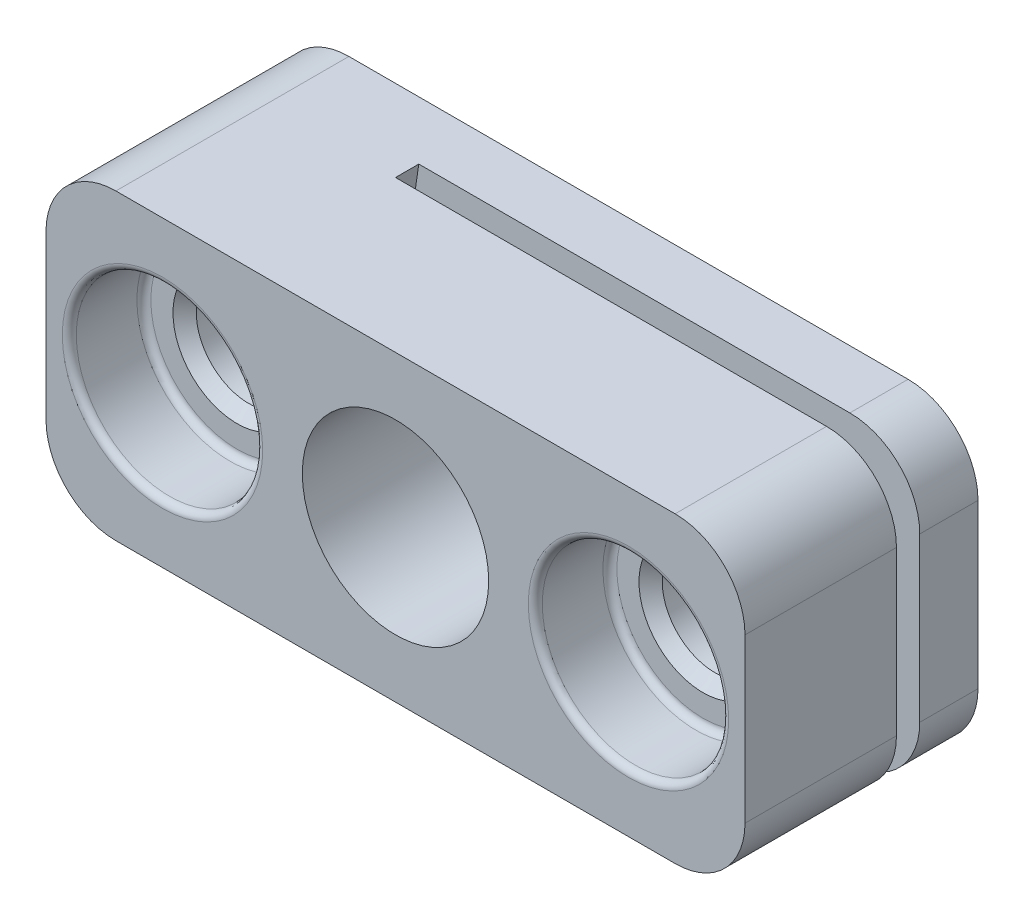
ISO-10303-21;
HEADER;
FILE_DESCRIPTION(('STEP AP214'),'2;1');
FILE_NAME('part.step','',(''),(''),'','','');
FILE_SCHEMA(('AUTOMOTIVE_DESIGN { 1 0 10303 214 1 1 1 1 }'));
ENDSEC;
DATA;
#1=APPLICATION_CONTEXT('core data for automotive mechanical design processes');
#2=APPLICATION_PROTOCOL_DEFINITION('international standard','automotive_design',2000,#1);
#3=PRODUCT_CONTEXT('',#1,'mechanical');
#4=PRODUCT('Part','Part','',(#3));
#5=PRODUCT_RELATED_PRODUCT_CATEGORY('part','',(#4));
#6=PRODUCT_DEFINITION_FORMATION('','',#4);
#7=PRODUCT_DEFINITION_CONTEXT('part definition',#1,'design');
#8=PRODUCT_DEFINITION('design','',#6,#7);
#9=PRODUCT_DEFINITION_SHAPE('','',#8);
#10=(LENGTH_UNIT() NAMED_UNIT(*) SI_UNIT(.MILLI.,.METRE.));
#11=(NAMED_UNIT(*) PLANE_ANGLE_UNIT() SI_UNIT($,.RADIAN.));
#12=(NAMED_UNIT(*) SI_UNIT($,.STERADIAN.) SOLID_ANGLE_UNIT());
#13=UNCERTAINTY_MEASURE_WITH_UNIT(LENGTH_MEASURE(1.E-05),#10,'distance_accuracy_value','');
#14=(GEOMETRIC_REPRESENTATION_CONTEXT(3) GLOBAL_UNCERTAINTY_ASSIGNED_CONTEXT((#13)) GLOBAL_UNIT_ASSIGNED_CONTEXT((#10,
#11,#12)) REPRESENTATION_CONTEXT('',''));
#15=CARTESIAN_POINT('',(0.,0.,0.));
#16=DIRECTION('',(0.,0.,1.));
#17=DIRECTION('',(1.,0.,0.));
#18=AXIS2_PLACEMENT_3D('',#15,#16,#17);
#19=CARTESIAN_POINT('',(22.75,0.,6.8));
#20=DIRECTION('',(0.,0.,1.));
#21=DIRECTION('',(1.,0.,0.));
#22=AXIS2_PLACEMENT_3D('',#19,#20,#21);
#23=PLANE('',#22);
#24=CARTESIAN_POINT('',(20.,0.,6.79999999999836));
#25=DIRECTION('',(0.,0.,1.));
#26=DIRECTION('',(1.,0.,0.));
#27=AXIS2_PLACEMENT_3D('',#24,#25,#26);
#28=CIRCLE('',#27,2.74999999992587);
#29=CARTESIAN_POINT('',(22.7499999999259,0.,6.79999999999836));
#30=VERTEX_POINT('',#29);
#31=EDGE_CURVE('E18',#30,#30,#28,.F.);
#32=ORIENTED_EDGE('',*,*,#31,.T.);
#33=EDGE_LOOP('',(#32));
#34=FACE_BOUND('',#33,.T.);
#35=CARTESIAN_POINT('',(20.,0.,6.8));
#36=DIRECTION('',(0.,0.,-1.));
#37=DIRECTION('',(1.,0.,0.));
#38=AXIS2_PLACEMENT_3D('',#35,#36,#37);
#39=CIRCLE('',#38,3.70000000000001);
#40=CARTESIAN_POINT('',(23.7,0.,6.8));
#41=VERTEX_POINT('',#40);
#42=EDGE_CURVE('E285',#41,#41,#39,.F.);
#43=ORIENTED_EDGE('',*,*,#42,.T.);
#44=EDGE_LOOP('',(#43));
#45=FACE_BOUND('',#44,.T.);
#46=ADVANCED_FACE('F14',(#34,#45),#23,.T.);
#47=CARTESIAN_POINT('',(20.,0.,7.1));
#48=DIRECTION('',(0.,0.,1.));
#49=DIRECTION('',(1.,0.,0.));
#50=AXIS2_PLACEMENT_3D('',#47,#48,#49);
#51=TOROIDAL_SURFACE('',#50,3.7,0.300000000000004);
#52=CARTESIAN_POINT('',(20.,0.,7.09999999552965));
#53=DIRECTION('',(0.,0.,-1.));
#54=DIRECTION('',(-1.,0.,0.));
#55=AXIS2_PLACEMENT_3D('',#52,#53,#54);
#56=CIRCLE('',#55,4.);
#57=CARTESIAN_POINT('',(16.,0.,7.09999999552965));
#58=VERTEX_POINT('',#57);
#59=EDGE_CURVE('E234',#58,#58,#56,.F.);
#60=ORIENTED_EDGE('',*,*,#59,.T.);
#61=EDGE_LOOP('',(#60));
#62=FACE_BOUND('',#61,.T.);
#63=ORIENTED_EDGE('',*,*,#42,.F.);
#64=EDGE_LOOP('',(#63));
#65=FACE_BOUND('',#64,.T.);
#66=ADVANCED_FACE('F267',(#62,#65),#51,.F.);
#67=CARTESIAN_POINT('',(0.,0.,7.1));
#68=DIRECTION('',(0.,0.,-1.));
#69=DIRECTION('',(-1.,0.,0.));
#70=AXIS2_PLACEMENT_3D('',#67,#68,#69);
#71=TOROIDAL_SURFACE('',#70,3.7,0.3);
#72=CARTESIAN_POINT('',(0.,0.,6.8));
#73=DIRECTION('',(0.,0.,-1.));
#74=DIRECTION('',(-1.,0.,0.));
#75=AXIS2_PLACEMENT_3D('',#72,#73,#74);
#76=CIRCLE('',#75,3.7);
#77=CARTESIAN_POINT('',(-3.7,0.,6.8));
#78=VERTEX_POINT('',#77);
#79=EDGE_CURVE('E245',#78,#78,#76,.F.);
#80=ORIENTED_EDGE('',*,*,#79,.F.);
#81=EDGE_LOOP('',(#80));
#82=FACE_BOUND('',#81,.T.);
#83=CARTESIAN_POINT('',(0.,0.,7.1));
#84=DIRECTION('',(0.,0.,1.));
#85=DIRECTION('',(1.,0.,0.));
#86=AXIS2_PLACEMENT_3D('',#83,#84,#85);
#87=CIRCLE('',#86,4.);
#88=CARTESIAN_POINT('',(4.,0.,7.1));
#89=VERTEX_POINT('',#88);
#90=EDGE_CURVE('E231',#89,#89,#87,.T.);
#91=ORIENTED_EDGE('',*,*,#90,.T.);
#92=EDGE_LOOP('',(#91));
#93=FACE_BOUND('',#92,.T.);
#94=ADVANCED_FACE('F263',(#82,#93),#71,.F.);
#95=CARTESIAN_POINT('',(-3.7,0.,6.8));
#96=DIRECTION('',(0.,0.,1.));
#97=DIRECTION('',(1.,0.,0.));
#98=AXIS2_PLACEMENT_3D('',#95,#96,#97);
#99=PLANE('',#98);
#100=ORIENTED_EDGE('',*,*,#79,.T.);
#101=EDGE_LOOP('',(#100));
#102=FACE_BOUND('',#101,.T.);
#103=CARTESIAN_POINT('',(0.,0.,6.79999999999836));
#104=DIRECTION('',(0.,0.,1.));
#105=DIRECTION('',(1.,0.,0.));
#106=AXIS2_PLACEMENT_3D('',#103,#104,#105);
#107=CIRCLE('',#106,2.75000000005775);
#108=CARTESIAN_POINT('',(2.75000000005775,0.,6.79999999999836));
#109=VERTEX_POINT('',#108);
#110=EDGE_CURVE('E228',#109,#109,#107,.F.);
#111=ORIENTED_EDGE('',*,*,#110,.T.);
#112=EDGE_LOOP('',(#111));
#113=FACE_BOUND('',#112,.T.);
#114=ADVANCED_FACE('F252',(#102,#113),#99,.T.);
#115=CARTESIAN_POINT('',(20.,0.,6.79999999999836));
#116=DIRECTION('',(0.,0.,1.));
#117=DIRECTION('',(1.,0.,0.));
#118=AXIS2_PLACEMENT_3D('',#115,#116,#117);
#119=CONICAL_SURFACE('',#118,2.74999999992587,0.785398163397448);
#120=CARTESIAN_POINT('',(20.,0.,6.3));
#121=DIRECTION('',(0.,0.,-1.));
#122=DIRECTION('',(-1.,0.,0.));
#123=AXIS2_PLACEMENT_3D('',#120,#121,#122);
#124=CIRCLE('',#123,2.25);
#125=CARTESIAN_POINT('',(17.75,0.,6.3));
#126=VERTEX_POINT('',#125);
#127=EDGE_CURVE('E224',#126,#126,#124,.T.);
#128=ORIENTED_EDGE('',*,*,#127,.T.);
#129=EDGE_LOOP('',(#128));
#130=FACE_BOUND('',#129,.T.);
#131=ORIENTED_EDGE('',*,*,#31,.F.);
#132=EDGE_LOOP('',(#131));
#133=FACE_BOUND('',#132,.T.);
#134=ADVANCED_FACE('F262',(#130,#133),#119,.F.);
#135=CARTESIAN_POINT('',(20.,0.,10.));
#136=DIRECTION('',(0.,0.,-1.));
#137=DIRECTION('',(-1.,0.,0.));
#138=AXIS2_PLACEMENT_3D('',#135,#136,#137);
#139=CYLINDRICAL_SURFACE('',#138,4.);
#140=ORIENTED_EDGE('',*,*,#59,.F.);
#141=EDGE_LOOP('',(#140));
#142=FACE_BOUND('',#141,.T.);
#143=CARTESIAN_POINT('',(20.,0.,9.7));
#144=DIRECTION('',(0.,0.,1.));
#145=DIRECTION('',(1.,0.,0.));
#146=AXIS2_PLACEMENT_3D('',#143,#144,#145);
#147=CIRCLE('',#146,4.);
#148=CARTESIAN_POINT('',(24.,0.,9.7));
#149=VERTEX_POINT('',#148);
#150=EDGE_CURVE('E125',#149,#149,#147,.F.);
#151=ORIENTED_EDGE('',*,*,#150,.F.);
#152=EDGE_LOOP('',(#151));
#153=FACE_BOUND('',#152,.T.);
#154=ADVANCED_FACE('F505',(#142,#153),#139,.F.);
#155=CARTESIAN_POINT('',(0.,0.,0.));
#156=DIRECTION('',(0.,0.,1.));
#157=DIRECTION('',(1.,0.,0.));
#158=AXIS2_PLACEMENT_3D('',#155,#156,#157);
#159=CYLINDRICAL_SURFACE('',#158,4.);
#160=CARTESIAN_POINT('',(0.,0.,9.7));
#161=DIRECTION('',(0.,0.,-1.));
#162=DIRECTION('',(-1.,0.,0.));
#163=AXIS2_PLACEMENT_3D('',#160,#161,#162);
#164=CIRCLE('',#163,4.);
#165=CARTESIAN_POINT('',(-4.,0.,9.7));
#166=VERTEX_POINT('',#165);
#167=EDGE_CURVE('E171',#166,#166,#164,.T.);
#168=ORIENTED_EDGE('',*,*,#167,.F.);
#169=EDGE_LOOP('',(#168));
#170=FACE_BOUND('',#169,.T.);
#171=ORIENTED_EDGE('',*,*,#90,.F.);
#172=EDGE_LOOP('',(#171));
#173=FACE_BOUND('',#172,.T.);
#174=ADVANCED_FACE('F349',(#170,#173),#159,.F.);
#175=CARTESIAN_POINT('',(0.,0.,6.79999999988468));
#176=DIRECTION('',(0.,0.,1.));
#177=DIRECTION('',(1.,0.,0.));
#178=AXIS2_PLACEMENT_3D('',#175,#176,#177);
#179=CONICAL_SURFACE('',#178,2.74999999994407,0.785398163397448);
#180=ORIENTED_EDGE('',*,*,#110,.F.);
#181=EDGE_LOOP('',(#180));
#182=FACE_BOUND('',#181,.T.);
#183=CARTESIAN_POINT('',(0.,0.,6.3));
#184=DIRECTION('',(0.,0.,1.));
#185=DIRECTION('',(1.,0.,0.));
#186=AXIS2_PLACEMENT_3D('',#183,#184,#185);
#187=CIRCLE('',#186,2.25);
#188=CARTESIAN_POINT('',(2.25,0.,6.3));
#189=VERTEX_POINT('',#188);
#190=EDGE_CURVE('E167',#189,#189,#187,.F.);
#191=ORIENTED_EDGE('',*,*,#190,.T.);
#192=EDGE_LOOP('',(#191));
#193=FACE_BOUND('',#192,.T.);
#194=ADVANCED_FACE('F345',(#182,#193),#179,.F.);
#195=CARTESIAN_POINT('',(20.,0.,10.));
#196=DIRECTION('',(0.,0.,-1.));
#197=DIRECTION('',(-1.,0.,0.));
#198=AXIS2_PLACEMENT_3D('',#195,#196,#197);
#199=CYLINDRICAL_SURFACE('',#198,2.25);
#200=CARTESIAN_POINT('',(20.,0.,3.5));
#201=DIRECTION('',(0.,0.,-1.));
#202=DIRECTION('',(-1.,0.,0.));
#203=AXIS2_PLACEMENT_3D('',#200,#201,#202);
#204=CIRCLE('',#203,2.25);
#205=CARTESIAN_POINT('',(17.75,0.,3.5));
#206=VERTEX_POINT('',#205);
#207=EDGE_CURVE('E135',#206,#206,#204,.T.);
#208=ORIENTED_EDGE('',*,*,#207,.T.);
#209=EDGE_LOOP('',(#208));
#210=FACE_BOUND('',#209,.T.);
#211=ORIENTED_EDGE('',*,*,#127,.F.);
#212=EDGE_LOOP('',(#211));
#213=FACE_BOUND('',#212,.T.);
#214=ADVANCED_FACE('F348',(#210,#213),#199,.F.);
#215=CARTESIAN_POINT('',(42.9683417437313,0.,3.5));
#216=DIRECTION('',(0.,0.,1.));
#217=DIRECTION('',(1.,0.,0.));
#218=AXIS2_PLACEMENT_3D('',#215,#216,#217);
#219=CYLINDRICAL_SURFACE('',#218,39.9999999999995);
#220=DIRECTION('',(0.,0.,1.));
#221=VECTOR('',#220,1.);
#222=CARTESIAN_POINT('',(3.5,6.5,3.5));
#223=LINE('',#222,#221);
#224=CARTESIAN_POINT('',(3.5,6.5,3.5));
#225=VERTEX_POINT('',#224);
#226=CARTESIAN_POINT('',(3.5,6.5,2.5));
#227=VERTEX_POINT('',#226);
#228=EDGE_CURVE('E113',#225,#227,#223,.F.);
#229=ORIENTED_EDGE('',*,*,#228,.F.);
#230=CARTESIAN_POINT('',(42.9683417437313,0.,3.5));
#231=DIRECTION('',(0.,0.,1.));
#232=DIRECTION('',(1.,0.,0.));
#233=AXIS2_PLACEMENT_3D('',#230,#231,#232);
#234=CIRCLE('',#233,39.9999999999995);
#235=CARTESIAN_POINT('',(3.50000000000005,-6.5,3.5));
#236=VERTEX_POINT('',#235);
#237=EDGE_CURVE('E177',#225,#236,#234,.T.);
#238=ORIENTED_EDGE('',*,*,#237,.T.);
#239=DIRECTION('',(0.,0.,1.));
#240=VECTOR('',#239,1.);
#241=CARTESIAN_POINT('',(3.50000000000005,-6.5,3.5));
#242=LINE('',#241,#240);
#243=CARTESIAN_POINT('',(3.50000000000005,-6.5,2.5));
#244=VERTEX_POINT('',#243);
#245=EDGE_CURVE('E126',#244,#236,#242,.T.);
#246=ORIENTED_EDGE('',*,*,#245,.F.);
#247=CARTESIAN_POINT('',(42.9683417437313,0.,2.5));
#248=DIRECTION('',(0.,0.,1.));
#249=DIRECTION('',(1.,0.,0.));
#250=AXIS2_PLACEMENT_3D('',#247,#248,#249);
#251=CIRCLE('',#250,39.9999999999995);
#252=EDGE_CURVE('E130',#227,#244,#251,.T.);
#253=ORIENTED_EDGE('',*,*,#252,.F.);
#254=EDGE_LOOP('',(#229,#238,#246,#253));
#255=FACE_BOUND('',#254,.T.);
#256=ADVANCED_FACE('F131',(#255),#219,.F.);
#257=CARTESIAN_POINT('',(20.,0.,9.7));
#258=DIRECTION('',(0.,0.,1.));
#259=DIRECTION('',(1.,0.,0.));
#260=AXIS2_PLACEMENT_3D('',#257,#258,#259);
#261=TOROIDAL_SURFACE('',#260,4.3,0.3);
#262=ORIENTED_EDGE('',*,*,#150,.T.);
#263=EDGE_LOOP('',(#262));
#264=FACE_BOUND('',#263,.T.);
#265=CARTESIAN_POINT('',(20.,0.,10.));
#266=DIRECTION('',(0.,0.,1.));
#267=DIRECTION('',(1.,0.,0.));
#268=AXIS2_PLACEMENT_3D('',#265,#266,#267);
#269=CIRCLE('',#268,4.3);
#270=CARTESIAN_POINT('',(24.3,0.,10.));
#271=VERTEX_POINT('',#270);
#272=EDGE_CURVE('E215',#271,#271,#269,.F.);
#273=ORIENTED_EDGE('',*,*,#272,.F.);
#274=EDGE_LOOP('',(#273));
#275=FACE_BOUND('',#274,.T.);
#276=ADVANCED_FACE('F189',(#264,#275),#261,.T.);
#277=CARTESIAN_POINT('',(0.,0.,9.7));
#278=DIRECTION('',(0.,0.,-1.));
#279=DIRECTION('',(-1.,0.,0.));
#280=AXIS2_PLACEMENT_3D('',#277,#278,#279);
#281=TOROIDAL_SURFACE('',#280,4.3,0.3);
#282=CARTESIAN_POINT('',(0.,0.,10.));
#283=DIRECTION('',(0.,0.,1.));
#284=DIRECTION('',(-1.,0.,0.));
#285=AXIS2_PLACEMENT_3D('',#282,#283,#284);
#286=CIRCLE('',#285,4.3);
#287=CARTESIAN_POINT('',(-4.3,0.,10.));
#288=VERTEX_POINT('',#287);
#289=EDGE_CURVE('E331',#288,#288,#286,.F.);
#290=ORIENTED_EDGE('',*,*,#289,.F.);
#291=EDGE_LOOP('',(#290));
#292=FACE_BOUND('',#291,.T.);
#293=ORIENTED_EDGE('',*,*,#167,.T.);
#294=EDGE_LOOP('',(#293));
#295=FACE_BOUND('',#294,.T.);
#296=ADVANCED_FACE('F183',(#292,#295),#281,.T.);
#297=CARTESIAN_POINT('',(25.,-3.5,10.));
#298=DIRECTION('',(-1.,0.,0.));
#299=DIRECTION('',(0.,0.,1.));
#300=AXIS2_PLACEMENT_3D('',#297,#298,#299);
#301=PLANE('',#300);
#302=DIRECTION('',(0.,1.,0.));
#303=VECTOR('',#302,1.);
#304=CARTESIAN_POINT('',(25.,0.,3.5));
#305=LINE('',#304,#303);
#306=CARTESIAN_POINT('',(25.,-3.5,3.5));
#307=VERTEX_POINT('',#306);
#308=CARTESIAN_POINT('',(25.,3.5,3.5));
#309=VERTEX_POINT('',#308);
#310=EDGE_CURVE('E334',#307,#309,#305,.T.);
#311=ORIENTED_EDGE('',*,*,#310,.T.);
#312=DIRECTION('',(0.,0.,1.));
#313=VECTOR('',#312,1.);
#314=CARTESIAN_POINT('',(25.,3.5,10.));
#315=LINE('',#314,#313);
#316=CARTESIAN_POINT('',(25.,3.5,10.));
#317=VERTEX_POINT('',#316);
#318=EDGE_CURVE('E174',#317,#309,#315,.F.);
#319=ORIENTED_EDGE('',*,*,#318,.F.);
#320=DIRECTION('',(0.,1.,0.));
#321=VECTOR('',#320,1.);
#322=CARTESIAN_POINT('',(25.,-3.5,10.));
#323=LINE('',#322,#321);
#324=CARTESIAN_POINT('',(25.,-3.5,10.));
#325=VERTEX_POINT('',#324);
#326=EDGE_CURVE('E327',#325,#317,#323,.T.);
#327=ORIENTED_EDGE('',*,*,#326,.F.);
#328=DIRECTION('',(0.,0.,1.));
#329=VECTOR('',#328,1.);
#330=CARTESIAN_POINT('',(25.,-3.5,10.));
#331=LINE('',#330,#329);
#332=EDGE_CURVE('E170',#307,#325,#331,.T.);
#333=ORIENTED_EDGE('',*,*,#332,.F.);
#334=EDGE_LOOP('',(#311,#319,#327,#333));
#335=FACE_BOUND('',#334,.T.);
#336=ADVANCED_FACE('F188',(#335),#301,.F.);
#337=CARTESIAN_POINT('',(20.,0.,10.));
#338=DIRECTION('',(0.,0.,-1.));
#339=DIRECTION('',(-1.,0.,0.));
#340=AXIS2_PLACEMENT_3D('',#337,#338,#339);
#341=CYLINDRICAL_SURFACE('',#340,2.25);
#342=CARTESIAN_POINT('',(20.,0.,0.499999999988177));
#343=DIRECTION('',(0.,0.,-1.));
#344=DIRECTION('',(-1.,0.,0.));
#345=AXIS2_PLACEMENT_3D('',#342,#343,#344);
#346=CIRCLE('',#345,2.25000000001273);
#347=CARTESIAN_POINT('',(17.7499999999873,0.,0.499999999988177));
#348=VERTEX_POINT('',#347);
#349=EDGE_CURVE('E326',#348,#348,#346,.T.);
#350=ORIENTED_EDGE('',*,*,#349,.T.);
#351=EDGE_LOOP('',(#350));
#352=FACE_BOUND('',#351,.T.);
#353=CARTESIAN_POINT('',(20.,0.,2.5));
#354=DIRECTION('',(0.,0.,-1.));
#355=DIRECTION('',(-1.,0.,0.));
#356=AXIS2_PLACEMENT_3D('',#353,#354,#355);
#357=CIRCLE('',#356,2.25);
#358=CARTESIAN_POINT('',(17.75,0.,2.5));
#359=VERTEX_POINT('',#358);
#360=EDGE_CURVE('E136',#359,#359,#357,.T.);
#361=ORIENTED_EDGE('',*,*,#360,.F.);
#362=EDGE_LOOP('',(#361));
#363=FACE_BOUND('',#362,.T.);
#364=ADVANCED_FACE('F357',(#352,#363),#341,.F.);
#365=CARTESIAN_POINT('',(0.,0.,0.));
#366=DIRECTION('',(0.,0.,1.));
#367=DIRECTION('',(1.,0.,0.));
#368=AXIS2_PLACEMENT_3D('',#365,#366,#367);
#369=CYLINDRICAL_SURFACE('',#368,2.25);
#370=ORIENTED_EDGE('',*,*,#190,.F.);
#371=EDGE_LOOP('',(#370));
#372=FACE_BOUND('',#371,.T.);
#373=CARTESIAN_POINT('',(0.,0.,0.499999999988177));
#374=DIRECTION('',(0.,0.,-1.));
#375=DIRECTION('',(-1.,0.,0.));
#376=AXIS2_PLACEMENT_3D('',#373,#374,#375);
#377=CIRCLE('',#376,2.2499999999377);
#378=CARTESIAN_POINT('',(-2.2499999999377,0.,0.499999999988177));
#379=VERTEX_POINT('',#378);
#380=EDGE_CURVE('E323',#379,#379,#377,.T.);
#381=ORIENTED_EDGE('',*,*,#380,.T.);
#382=EDGE_LOOP('',(#381));
#383=FACE_BOUND('',#382,.T.);
#384=ADVANCED_FACE('F353',(#372,#383),#369,.F.);
#385=CARTESIAN_POINT('',(22.,-3.5,10.));
#386=DIRECTION('',(0.,0.,1.));
#387=DIRECTION('',(1.,0.,0.));
#388=AXIS2_PLACEMENT_3D('',#385,#386,#387);
#389=CYLINDRICAL_SURFACE('',#388,3.);
#390=ORIENTED_EDGE('',*,*,#332,.T.);
#391=CARTESIAN_POINT('',(22.,-3.5,10.));
#392=DIRECTION('',(0.,0.,1.));
#393=DIRECTION('',(1.,0.,0.));
#394=AXIS2_PLACEMENT_3D('',#391,#392,#393);
#395=CIRCLE('',#394,3.);
#396=CARTESIAN_POINT('',(22.,-6.5,10.));
#397=VERTEX_POINT('',#396);
#398=EDGE_CURVE('E328',#397,#325,#395,.T.);
#399=ORIENTED_EDGE('',*,*,#398,.F.);
#400=DIRECTION('',(0.,0.,1.));
#401=VECTOR('',#400,1.);
#402=CARTESIAN_POINT('',(22.,-6.5,10.));
#403=LINE('',#402,#401);
#404=CARTESIAN_POINT('',(22.,-6.5,3.5));
#405=VERTEX_POINT('',#404);
#406=EDGE_CURVE('E157',#397,#405,#403,.F.);
#407=ORIENTED_EDGE('',*,*,#406,.T.);
#408=CARTESIAN_POINT('',(22.,-3.5,3.5));
#409=DIRECTION('',(0.,0.,1.));
#410=DIRECTION('',(1.,0.,0.));
#411=AXIS2_PLACEMENT_3D('',#408,#409,#410);
#412=CIRCLE('',#411,3.);
#413=EDGE_CURVE('E335',#405,#307,#412,.T.);
#414=ORIENTED_EDGE('',*,*,#413,.T.);
#415=EDGE_LOOP('',(#390,#399,#407,#414));
#416=FACE_BOUND('',#415,.T.);
#417=ADVANCED_FACE('F356',(#416),#389,.T.);
#418=CARTESIAN_POINT('',(42.9683417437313,0.,2.5));
#419=DIRECTION('',(0.,0.,1.));
#420=DIRECTION('',(1.,0.,0.));
#421=AXIS2_PLACEMENT_3D('',#418,#419,#420);
#422=PLANE('',#421);
#423=CARTESIAN_POINT('',(10.,0.,2.5));
#424=DIRECTION('',(0.,0.,1.));
#425=DIRECTION('',(1.,0.,0.));
#426=AXIS2_PLACEMENT_3D('',#423,#424,#425);
#427=CIRCLE('',#426,4.0000000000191);
#428=CARTESIAN_POINT('',(14.0000000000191,0.,2.5));
#429=VERTEX_POINT('',#428);
#430=EDGE_CURVE('E455',#429,#429,#427,.T.);
#431=ORIENTED_EDGE('',*,*,#430,.F.);
#432=EDGE_LOOP('',(#431));
#433=FACE_BOUND('',#432,.T.);
#434=ORIENTED_EDGE('',*,*,#252,.T.);
#435=DIRECTION('',(1.,0.,0.));
#436=VECTOR('',#435,1.);
#437=CARTESIAN_POINT('',(-2.,-6.5,2.5));
#438=LINE('',#437,#436);
#439=CARTESIAN_POINT('',(22.,-6.5,2.5));
#440=VERTEX_POINT('',#439);
#441=EDGE_CURVE('E153',#244,#440,#438,.T.);
#442=ORIENTED_EDGE('',*,*,#441,.T.);
#443=CARTESIAN_POINT('',(22.,-3.5,2.5));
#444=DIRECTION('',(0.,0.,1.));
#445=DIRECTION('',(1.,0.,0.));
#446=AXIS2_PLACEMENT_3D('',#443,#444,#445);
#447=CIRCLE('',#446,3.);
#448=CARTESIAN_POINT('',(25.,-3.5,2.5));
#449=VERTEX_POINT('',#448);
#450=EDGE_CURVE('E164',#449,#440,#447,.F.);
#451=ORIENTED_EDGE('',*,*,#450,.F.);
#452=DIRECTION('',(0.,1.,0.));
#453=VECTOR('',#452,1.);
#454=CARTESIAN_POINT('',(25.,-3.5,2.5));
#455=LINE('',#454,#453);
#456=CARTESIAN_POINT('',(25.,3.5,2.5));
#457=VERTEX_POINT('',#456);
#458=EDGE_CURVE('E150',#449,#457,#455,.T.);
#459=ORIENTED_EDGE('',*,*,#458,.T.);
#460=CARTESIAN_POINT('',(22.,3.5,2.5));
#461=DIRECTION('',(0.,0.,1.));
#462=DIRECTION('',(1.,0.,0.));
#463=AXIS2_PLACEMENT_3D('',#460,#461,#462);
#464=CIRCLE('',#463,3.);
#465=CARTESIAN_POINT('',(22.,6.5,2.5));
#466=VERTEX_POINT('',#465);
#467=EDGE_CURVE('E141',#466,#457,#464,.F.);
#468=ORIENTED_EDGE('',*,*,#467,.F.);
#469=DIRECTION('',(1.,0.,0.));
#470=VECTOR('',#469,1.);
#471=CARTESIAN_POINT('',(22.,6.5,2.5));
#472=LINE('',#471,#470);
#473=EDGE_CURVE('E117',#466,#227,#472,.F.);
#474=ORIENTED_EDGE('',*,*,#473,.T.);
#475=EDGE_LOOP('',(#434,#442,#451,#459,#468,#474));
#476=FACE_BOUND('',#475,.T.);
#477=ORIENTED_EDGE('',*,*,#360,.T.);
#478=EDGE_LOOP('',(#477));
#479=FACE_BOUND('',#478,.T.);
#480=ADVANCED_FACE('F138',(#433,#476,#479),#422,.T.);
#481=CARTESIAN_POINT('',(42.9683417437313,0.,3.5));
#482=DIRECTION('',(0.,0.,1.));
#483=DIRECTION('',(1.,0.,0.));
#484=AXIS2_PLACEMENT_3D('',#481,#482,#483);
#485=PLANE('',#484);
#486=CARTESIAN_POINT('',(10.,0.,3.5));
#487=DIRECTION('',(0.,0.,1.));
#488=DIRECTION('',(1.,0.,0.));
#489=AXIS2_PLACEMENT_3D('',#486,#487,#488);
#490=CIRCLE('',#489,4.0000000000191);
#491=CARTESIAN_POINT('',(14.0000000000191,0.,3.5));
#492=VERTEX_POINT('',#491);
#493=EDGE_CURVE('E458',#492,#492,#490,.T.);
#494=ORIENTED_EDGE('',*,*,#493,.T.);
#495=EDGE_LOOP('',(#494));
#496=FACE_BOUND('',#495,.T.);
#497=ORIENTED_EDGE('',*,*,#237,.F.);
#498=DIRECTION('',(1.,0.,0.));
#499=VECTOR('',#498,1.);
#500=CARTESIAN_POINT('',(22.,6.5,3.5));
#501=LINE('',#500,#499);
#502=CARTESIAN_POINT('',(22.,6.5,3.5));
#503=VERTEX_POINT('',#502);
#504=EDGE_CURVE('E121',#225,#503,#501,.T.);
#505=ORIENTED_EDGE('',*,*,#504,.T.);
#506=CARTESIAN_POINT('',(22.,3.5,3.5));
#507=DIRECTION('',(0.,0.,1.));
#508=DIRECTION('',(1.,0.,0.));
#509=AXIS2_PLACEMENT_3D('',#506,#507,#508);
#510=CIRCLE('',#509,3.);
#511=EDGE_CURVE('E176',#309,#503,#510,.T.);
#512=ORIENTED_EDGE('',*,*,#511,.F.);
#513=ORIENTED_EDGE('',*,*,#310,.F.);
#514=ORIENTED_EDGE('',*,*,#413,.F.);
#515=DIRECTION('',(1.,0.,0.));
#516=VECTOR('',#515,1.);
#517=CARTESIAN_POINT('',(-2.,-6.5,3.5));
#518=LINE('',#517,#516);
#519=EDGE_CURVE('E160',#405,#236,#518,.F.);
#520=ORIENTED_EDGE('',*,*,#519,.T.);
#521=EDGE_LOOP('',(#497,#505,#512,#513,#514,#520));
#522=FACE_BOUND('',#521,.T.);
#523=ORIENTED_EDGE('',*,*,#207,.F.);
#524=EDGE_LOOP('',(#523));
#525=FACE_BOUND('',#524,.T.);
#526=ADVANCED_FACE('F418',(#496,#522,#525),#485,.F.);
#527=CARTESIAN_POINT('',(22.,3.5,10.));
#528=DIRECTION('',(0.,0.,1.));
#529=DIRECTION('',(1.,0.,0.));
#530=AXIS2_PLACEMENT_3D('',#527,#528,#529);
#531=CYLINDRICAL_SURFACE('',#530,3.);
#532=DIRECTION('',(0.,0.,-1.));
#533=VECTOR('',#532,1.);
#534=CARTESIAN_POINT('',(22.,6.5,10.));
#535=LINE('',#534,#533);
#536=CARTESIAN_POINT('',(22.,6.5,10.));
#537=VERTEX_POINT('',#536);
#538=EDGE_CURVE('E144',#503,#537,#535,.F.);
#539=ORIENTED_EDGE('',*,*,#538,.T.);
#540=CARTESIAN_POINT('',(22.,3.5,10.));
#541=DIRECTION('',(0.,0.,1.));
#542=DIRECTION('',(1.,0.,0.));
#543=AXIS2_PLACEMENT_3D('',#540,#541,#542);
#544=CIRCLE('',#543,3.);
#545=EDGE_CURVE('E324',#317,#537,#544,.T.);
#546=ORIENTED_EDGE('',*,*,#545,.F.);
#547=ORIENTED_EDGE('',*,*,#318,.T.);
#548=ORIENTED_EDGE('',*,*,#511,.T.);
#549=EDGE_LOOP('',(#539,#546,#547,#548));
#550=FACE_BOUND('',#549,.T.);
#551=ADVANCED_FACE('F394',(#550),#531,.T.);
#552=CARTESIAN_POINT('',(-2.,-3.5,10.));
#553=DIRECTION('',(0.,0.,1.));
#554=DIRECTION('',(1.,0.,0.));
#555=AXIS2_PLACEMENT_3D('',#552,#553,#554);
#556=PLANE('',#555);
#557=DIRECTION('',(1.,0.,0.));
#558=VECTOR('',#557,1.);
#559=CARTESIAN_POINT('',(22.,6.5,10.));
#560=LINE('',#559,#558);
#561=CARTESIAN_POINT('',(-2.,6.5,10.));
#562=VERTEX_POINT('',#561);
#563=EDGE_CURVE('E146',#537,#562,#560,.F.);
#564=ORIENTED_EDGE('',*,*,#563,.T.);
#565=CARTESIAN_POINT('',(-2.,3.5,10.));
#566=DIRECTION('',(0.,0.,1.));
#567=DIRECTION('',(1.,0.,0.));
#568=AXIS2_PLACEMENT_3D('',#565,#566,#567);
#569=CIRCLE('',#568,3.);
#570=CARTESIAN_POINT('',(-5.,3.5,10.));
#571=VERTEX_POINT('',#570);
#572=EDGE_CURVE('E315',#571,#562,#569,.F.);
#573=ORIENTED_EDGE('',*,*,#572,.F.);
#574=DIRECTION('',(0.,1.,0.));
#575=VECTOR('',#574,1.);
#576=CARTESIAN_POINT('',(-5.,3.5,10.));
#577=LINE('',#576,#575);
#578=CARTESIAN_POINT('',(-5.,-3.5,10.));
#579=VERTEX_POINT('',#578);
#580=EDGE_CURVE('E372',#571,#579,#577,.F.);
#581=ORIENTED_EDGE('',*,*,#580,.T.);
#582=CARTESIAN_POINT('',(-2.,-3.5,10.));
#583=DIRECTION('',(0.,0.,1.));
#584=DIRECTION('',(1.,0.,0.));
#585=AXIS2_PLACEMENT_3D('',#582,#583,#584);
#586=CIRCLE('',#585,3.);
#587=CARTESIAN_POINT('',(-2.,-6.5,10.));
#588=VERTEX_POINT('',#587);
#589=EDGE_CURVE('E156',#588,#579,#586,.F.);
#590=ORIENTED_EDGE('',*,*,#589,.F.);
#591=DIRECTION('',(1.,0.,0.));
#592=VECTOR('',#591,1.);
#593=CARTESIAN_POINT('',(-2.,-6.5,10.));
#594=LINE('',#593,#592);
#595=EDGE_CURVE('E161',#588,#397,#594,.T.);
#596=ORIENTED_EDGE('',*,*,#595,.T.);
#597=ORIENTED_EDGE('',*,*,#398,.T.);
#598=ORIENTED_EDGE('',*,*,#326,.T.);
#599=ORIENTED_EDGE('',*,*,#545,.T.);
#600=EDGE_LOOP('',(#564,#573,#581,#590,#596,#597,#598,#599));
#601=FACE_BOUND('',#600,.T.);
#602=CARTESIAN_POINT('',(10.,0.,10.));
#603=DIRECTION('',(0.,0.,1.));
#604=DIRECTION('',(1.,0.,0.));
#605=AXIS2_PLACEMENT_3D('',#602,#603,#604);
#606=CIRCLE('',#605,4.0000000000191);
#607=CARTESIAN_POINT('',(14.0000000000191,0.,10.));
#608=VERTEX_POINT('',#607);
#609=EDGE_CURVE('E462',#608,#608,#606,.T.);
#610=ORIENTED_EDGE('',*,*,#609,.F.);
#611=EDGE_LOOP('',(#610));
#612=FACE_BOUND('',#611,.T.);
#613=ORIENTED_EDGE('',*,*,#289,.T.);
#614=EDGE_LOOP('',(#613));
#615=FACE_BOUND('',#614,.T.);
#616=ORIENTED_EDGE('',*,*,#272,.T.);
#617=EDGE_LOOP('',(#616));
#618=FACE_BOUND('',#617,.T.);
#619=ADVANCED_FACE('F383',(#601,#612,#615,#618),#556,.T.);
#620=CARTESIAN_POINT('',(20.,0.,5.6843418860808E-11));
#621=DIRECTION('',(0.,0.,-1.));
#622=DIRECTION('',(-1.,0.,0.));
#623=AXIS2_PLACEMENT_3D('',#620,#621,#622);
#624=CONICAL_SURFACE('',#623,2.74999999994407,0.785398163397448);
#625=CARTESIAN_POINT('',(20.,0.,5.6843418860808E-11));
#626=DIRECTION('',(0.,0.,-1.));
#627=DIRECTION('',(-1.,0.,0.));
#628=AXIS2_PLACEMENT_3D('',#625,#626,#627);
#629=CIRCLE('',#628,2.74999999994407);
#630=CARTESIAN_POINT('',(17.2500000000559,0.,5.6843418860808E-11));
#631=VERTEX_POINT('',#630);
#632=EDGE_CURVE('E311',#631,#631,#629,.T.);
#633=ORIENTED_EDGE('',*,*,#632,.T.);
#634=EDGE_LOOP('',(#633));
#635=FACE_BOUND('',#634,.T.);
#636=ORIENTED_EDGE('',*,*,#349,.F.);
#637=EDGE_LOOP('',(#636));
#638=FACE_BOUND('',#637,.T.);
#639=ADVANCED_FACE('F393',(#635,#638),#624,.F.);
#640=CARTESIAN_POINT('',(0.,0.,0.));
#641=DIRECTION('',(0.,0.,-1.));
#642=DIRECTION('',(-1.,0.,0.));
#643=AXIS2_PLACEMENT_3D('',#640,#641,#642);
#644=CONICAL_SURFACE('',#643,2.74999999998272,0.785398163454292);
#645=ORIENTED_EDGE('',*,*,#380,.F.);
#646=EDGE_LOOP('',(#645));
#647=FACE_BOUND('',#646,.T.);
#648=CARTESIAN_POINT('',(0.,0.,0.));
#649=DIRECTION('',(0.,0.,-1.));
#650=DIRECTION('',(-1.,0.,0.));
#651=AXIS2_PLACEMENT_3D('',#648,#649,#650);
#652=CIRCLE('',#651,2.74999999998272);
#653=CARTESIAN_POINT('',(-2.74999999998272,0.,0.));
#654=VERTEX_POINT('',#653);
#655=EDGE_CURVE('E308',#654,#654,#652,.T.);
#656=ORIENTED_EDGE('',*,*,#655,.T.);
#657=EDGE_LOOP('',(#656));
#658=FACE_BOUND('',#657,.T.);
#659=ADVANCED_FACE('F633',(#647,#658),#644,.F.);
#660=CARTESIAN_POINT('',(-2.,-3.5,10.));
#661=DIRECTION('',(0.,0.,1.));
#662=DIRECTION('',(1.,0.,0.));
#663=AXIS2_PLACEMENT_3D('',#660,#661,#662);
#664=CYLINDRICAL_SURFACE('',#663,3.);
#665=ORIENTED_EDGE('',*,*,#589,.T.);
#666=DIRECTION('',(0.,0.,-1.));
#667=VECTOR('',#666,1.);
#668=CARTESIAN_POINT('',(-5.,-3.5,10.));
#669=LINE('',#668,#667);
#670=CARTESIAN_POINT('',(-5.,-3.5,0.));
#671=VERTEX_POINT('',#670);
#672=EDGE_CURVE('E314',#579,#671,#669,.T.);
#673=ORIENTED_EDGE('',*,*,#672,.T.);
#674=CARTESIAN_POINT('',(-2.,-3.5,0.));
#675=DIRECTION('',(0.,0.,1.));
#676=DIRECTION('',(1.,0.,0.));
#677=AXIS2_PLACEMENT_3D('',#674,#675,#676);
#678=CIRCLE('',#677,3.);
#679=CARTESIAN_POINT('',(-2.,-6.5,0.));
#680=VERTEX_POINT('',#679);
#681=EDGE_CURVE('E305',#671,#680,#678,.T.);
#682=ORIENTED_EDGE('',*,*,#681,.T.);
#683=DIRECTION('',(0.,0.,1.));
#684=VECTOR('',#683,1.);
#685=CARTESIAN_POINT('',(-2.,-6.5,10.));
#686=LINE('',#685,#684);
#687=EDGE_CURVE('E155',#680,#588,#686,.T.);
#688=ORIENTED_EDGE('',*,*,#687,.T.);
#689=EDGE_LOOP('',(#665,#673,#682,#688));
#690=FACE_BOUND('',#689,.T.);
#691=ADVANCED_FACE('F642',(#690),#664,.T.);
#692=CARTESIAN_POINT('',(-2.,-6.5,10.));
#693=DIRECTION('',(0.,1.,0.));
#694=DIRECTION('',(0.,0.,1.));
#695=AXIS2_PLACEMENT_3D('',#692,#693,#694);
#696=PLANE('',#695);
#697=ORIENTED_EDGE('',*,*,#519,.F.);
#698=ORIENTED_EDGE('',*,*,#406,.F.);
#699=ORIENTED_EDGE('',*,*,#595,.F.);
#700=ORIENTED_EDGE('',*,*,#687,.F.);
#701=DIRECTION('',(1.,0.,0.));
#702=VECTOR('',#701,1.);
#703=CARTESIAN_POINT('',(-2.,-6.5,0.));
#704=LINE('',#703,#702);
#705=CARTESIAN_POINT('',(22.,-6.5,0.));
#706=VERTEX_POINT('',#705);
#707=EDGE_CURVE('E304',#680,#706,#704,.T.);
#708=ORIENTED_EDGE('',*,*,#707,.T.);
#709=DIRECTION('',(0.,0.,1.));
#710=VECTOR('',#709,1.);
#711=CARTESIAN_POINT('',(22.,-6.5,10.));
#712=LINE('',#711,#710);
#713=EDGE_CURVE('E321',#440,#706,#712,.F.);
#714=ORIENTED_EDGE('',*,*,#713,.F.);
#715=ORIENTED_EDGE('',*,*,#441,.F.);
#716=ORIENTED_EDGE('',*,*,#245,.T.);
#717=EDGE_LOOP('',(#697,#698,#699,#700,#708,#714,#715,#716));
#718=FACE_BOUND('',#717,.T.);
#719=ADVANCED_FACE('F431',(#718),#696,.F.);
#720=CARTESIAN_POINT('',(22.,-3.5,10.));
#721=DIRECTION('',(0.,0.,1.));
#722=DIRECTION('',(1.,0.,0.));
#723=AXIS2_PLACEMENT_3D('',#720,#721,#722);
#724=CYLINDRICAL_SURFACE('',#723,3.);
#725=CARTESIAN_POINT('',(22.,-3.5,0.));
#726=DIRECTION('',(0.,0.,1.));
#727=DIRECTION('',(1.,0.,0.));
#728=AXIS2_PLACEMENT_3D('',#725,#726,#727);
#729=CIRCLE('',#728,3.);
#730=CARTESIAN_POINT('',(25.,-3.5,0.));
#731=VERTEX_POINT('',#730);
#732=EDGE_CURVE('E301',#706,#731,#729,.T.);
#733=ORIENTED_EDGE('',*,*,#732,.T.);
#734=DIRECTION('',(0.,0.,1.));
#735=VECTOR('',#734,1.);
#736=CARTESIAN_POINT('',(25.,-3.5,10.));
#737=LINE('',#736,#735);
#738=EDGE_CURVE('E152',#731,#449,#737,.T.);
#739=ORIENTED_EDGE('',*,*,#738,.T.);
#740=ORIENTED_EDGE('',*,*,#450,.T.);
#741=ORIENTED_EDGE('',*,*,#713,.T.);
#742=EDGE_LOOP('',(#733,#739,#740,#741));
#743=FACE_BOUND('',#742,.T.);
#744=ADVANCED_FACE('F443',(#743),#724,.T.);
#745=CARTESIAN_POINT('',(25.,-3.5,10.));
#746=DIRECTION('',(-1.,0.,0.));
#747=DIRECTION('',(0.,0.,1.));
#748=AXIS2_PLACEMENT_3D('',#745,#746,#747);
#749=PLANE('',#748);
#750=ORIENTED_EDGE('',*,*,#738,.F.);
#751=DIRECTION('',(0.,1.,0.));
#752=VECTOR('',#751,1.);
#753=CARTESIAN_POINT('',(25.,-3.5,0.));
#754=LINE('',#753,#752);
#755=CARTESIAN_POINT('',(25.,3.5,0.));
#756=VERTEX_POINT('',#755);
#757=EDGE_CURVE('E300',#731,#756,#754,.T.);
#758=ORIENTED_EDGE('',*,*,#757,.T.);
#759=DIRECTION('',(0.,0.,1.));
#760=VECTOR('',#759,1.);
#761=CARTESIAN_POINT('',(25.,3.5,10.));
#762=LINE('',#761,#760);
#763=EDGE_CURVE('E319',#457,#756,#762,.F.);
#764=ORIENTED_EDGE('',*,*,#763,.F.);
#765=ORIENTED_EDGE('',*,*,#458,.F.);
#766=EDGE_LOOP('',(#750,#758,#764,#765));
#767=FACE_BOUND('',#766,.T.);
#768=ADVANCED_FACE('F440',(#767),#749,.F.);
#769=CARTESIAN_POINT('',(22.,3.5,10.));
#770=DIRECTION('',(0.,0.,1.));
#771=DIRECTION('',(1.,0.,0.));
#772=AXIS2_PLACEMENT_3D('',#769,#770,#771);
#773=CYLINDRICAL_SURFACE('',#772,3.);
#774=CARTESIAN_POINT('',(22.,3.5,0.));
#775=DIRECTION('',(0.,0.,1.));
#776=DIRECTION('',(1.,0.,0.));
#777=AXIS2_PLACEMENT_3D('',#774,#775,#776);
#778=CIRCLE('',#777,3.);
#779=CARTESIAN_POINT('',(22.,6.5,0.));
#780=VERTEX_POINT('',#779);
#781=EDGE_CURVE('E297',#756,#780,#778,.T.);
#782=ORIENTED_EDGE('',*,*,#781,.T.);
#783=DIRECTION('',(0.,0.,-1.));
#784=VECTOR('',#783,1.);
#785=CARTESIAN_POINT('',(22.,6.5,10.));
#786=LINE('',#785,#784);
#787=EDGE_CURVE('E142',#780,#466,#786,.F.);
#788=ORIENTED_EDGE('',*,*,#787,.T.);
#789=ORIENTED_EDGE('',*,*,#467,.T.);
#790=ORIENTED_EDGE('',*,*,#763,.T.);
#791=EDGE_LOOP('',(#782,#788,#789,#790));
#792=FACE_BOUND('',#791,.T.);
#793=ADVANCED_FACE('F675',(#792),#773,.T.);
#794=CARTESIAN_POINT('',(22.,6.5,10.));
#795=DIRECTION('',(0.,-1.,0.));
#796=DIRECTION('',(0.,0.,-1.));
#797=AXIS2_PLACEMENT_3D('',#794,#795,#796);
#798=PLANE('',#797);
#799=ORIENTED_EDGE('',*,*,#504,.F.);
#800=ORIENTED_EDGE('',*,*,#228,.T.);
#801=ORIENTED_EDGE('',*,*,#473,.F.);
#802=ORIENTED_EDGE('',*,*,#787,.F.);
#803=DIRECTION('',(1.,0.,0.));
#804=VECTOR('',#803,1.);
#805=CARTESIAN_POINT('',(-2.,6.5,0.));
#806=LINE('',#805,#804);
#807=CARTESIAN_POINT('',(-2.,6.5,0.));
#808=VERTEX_POINT('',#807);
#809=EDGE_CURVE('E296',#780,#808,#806,.F.);
#810=ORIENTED_EDGE('',*,*,#809,.T.);
#811=DIRECTION('',(0.,0.,1.));
#812=VECTOR('',#811,1.);
#813=CARTESIAN_POINT('',(-2.,6.5,10.));
#814=LINE('',#813,#812);
#815=EDGE_CURVE('E317',#562,#808,#814,.F.);
#816=ORIENTED_EDGE('',*,*,#815,.F.);
#817=ORIENTED_EDGE('',*,*,#563,.F.);
#818=ORIENTED_EDGE('',*,*,#538,.F.);
#819=EDGE_LOOP('',(#799,#800,#801,#802,#810,#816,#817,#818));
#820=FACE_BOUND('',#819,.T.);
#821=ADVANCED_FACE('F115',(#820),#798,.F.);
#822=CARTESIAN_POINT('',(-2.,3.5,10.));
#823=DIRECTION('',(0.,0.,1.));
#824=DIRECTION('',(1.,0.,0.));
#825=AXIS2_PLACEMENT_3D('',#822,#823,#824);
#826=CYLINDRICAL_SURFACE('',#825,3.);
#827=ORIENTED_EDGE('',*,*,#572,.T.);
#828=ORIENTED_EDGE('',*,*,#815,.T.);
#829=CARTESIAN_POINT('',(-2.,3.5,0.));
#830=DIRECTION('',(0.,0.,1.));
#831=DIRECTION('',(1.,0.,0.));
#832=AXIS2_PLACEMENT_3D('',#829,#830,#831);
#833=CIRCLE('',#832,3.);
#834=CARTESIAN_POINT('',(-5.,3.5,0.));
#835=VERTEX_POINT('',#834);
#836=EDGE_CURVE('E24',#808,#835,#833,.T.);
#837=ORIENTED_EDGE('',*,*,#836,.T.);
#838=DIRECTION('',(0.,0.,-1.));
#839=VECTOR('',#838,1.);
#840=CARTESIAN_POINT('',(-5.,3.5,10.));
#841=LINE('',#840,#839);
#842=EDGE_CURVE('E32',#835,#571,#841,.F.);
#843=ORIENTED_EDGE('',*,*,#842,.T.);
#844=EDGE_LOOP('',(#827,#828,#837,#843));
#845=FACE_BOUND('',#844,.T.);
#846=ADVANCED_FACE('F693',(#845),#826,.T.);
#847=CARTESIAN_POINT('',(-5.,3.5,10.));
#848=DIRECTION('',(1.,0.,0.));
#849=DIRECTION('',(0.,0.,-1.));
#850=AXIS2_PLACEMENT_3D('',#847,#848,#849);
#851=PLANE('',#850);
#852=ORIENTED_EDGE('',*,*,#672,.F.);
#853=ORIENTED_EDGE('',*,*,#580,.F.);
#854=ORIENTED_EDGE('',*,*,#842,.F.);
#855=DIRECTION('',(0.,1.,0.));
#856=VECTOR('',#855,1.);
#857=CARTESIAN_POINT('',(-5.,-3.5,0.));
#858=LINE('',#857,#856);
#859=EDGE_CURVE('E9',#835,#671,#858,.F.);
#860=ORIENTED_EDGE('',*,*,#859,.T.);
#861=EDGE_LOOP('',(#852,#853,#854,#860));
#862=FACE_BOUND('',#861,.T.);
#863=ADVANCED_FACE('F482',(#862),#851,.F.);
#864=CARTESIAN_POINT('',(-2.,-3.5,0.));
#865=DIRECTION('',(0.,0.,1.));
#866=DIRECTION('',(1.,0.,0.));
#867=AXIS2_PLACEMENT_3D('',#864,#865,#866);
#868=PLANE('',#867);
#869=ORIENTED_EDGE('',*,*,#836,.F.);
#870=ORIENTED_EDGE('',*,*,#809,.F.);
#871=ORIENTED_EDGE('',*,*,#781,.F.);
#872=ORIENTED_EDGE('',*,*,#757,.F.);
#873=ORIENTED_EDGE('',*,*,#732,.F.);
#874=ORIENTED_EDGE('',*,*,#707,.F.);
#875=ORIENTED_EDGE('',*,*,#681,.F.);
#876=ORIENTED_EDGE('',*,*,#859,.F.);
#877=EDGE_LOOP('',(#869,#870,#871,#872,#873,#874,#875,#876));
#878=FACE_BOUND('',#877,.T.);
#879=CARTESIAN_POINT('',(10.,0.,-5.6843418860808E-11));
#880=DIRECTION('',(0.,0.,1.));
#881=DIRECTION('',(1.,0.,0.));
#882=AXIS2_PLACEMENT_3D('',#879,#880,#881);
#883=CIRCLE('',#882,4.0000000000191);
#884=CARTESIAN_POINT('',(14.0000000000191,0.,-5.6843418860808E-11));
#885=VERTEX_POINT('',#884);
#886=EDGE_CURVE('E461',#885,#885,#883,.T.);
#887=ORIENTED_EDGE('',*,*,#886,.T.);
#888=EDGE_LOOP('',(#887));
#889=FACE_BOUND('',#888,.T.);
#890=ORIENTED_EDGE('',*,*,#655,.F.);
#891=EDGE_LOOP('',(#890));
#892=FACE_BOUND('',#891,.T.);
#893=ORIENTED_EDGE('',*,*,#632,.F.);
#894=EDGE_LOOP('',(#893));
#895=FACE_BOUND('',#894,.T.);
#896=ADVANCED_FACE('F468',(#878,#889,#892,#895),#868,.F.);
#897=CARTESIAN_POINT('',(10.,0.,-5.6843418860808E-11));
#898=DIRECTION('',(0.,0.,1.));
#899=DIRECTION('',(1.,0.,0.));
#900=AXIS2_PLACEMENT_3D('',#897,#898,#899);
#901=CYLINDRICAL_SURFACE('',#900,4.0000000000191);
#902=ORIENTED_EDGE('',*,*,#430,.T.);
#903=EDGE_LOOP('',(#902));
#904=FACE_BOUND('',#903,.T.);
#905=ORIENTED_EDGE('',*,*,#886,.F.);
#906=EDGE_LOOP('',(#905));
#907=FACE_BOUND('',#906,.T.);
#908=ADVANCED_FACE('F471',(#904,#907),#901,.F.);
#909=ORIENTED_EDGE('',*,*,#609,.T.);
#910=EDGE_LOOP('',(#909));
#911=FACE_BOUND('',#910,.T.);
#912=ORIENTED_EDGE('',*,*,#493,.F.);
#913=EDGE_LOOP('',(#912));
#914=FACE_BOUND('',#913,.T.);
#915=ADVANCED_FACE('F473',(#911,#914),#901,.F.);
#916=CLOSED_SHELL('',(#46,#66,#94,#114,#134,#154,#174,#194,#214,#256,#276,#296,#336,#364,#384,
#417,#480,#526,#551,#619,#639,#659,#691,#719,#744,#768,#793,#821,#846,#863,#896,#908,#915));
#917=MANIFOLD_SOLID_BREP('B1',#916);
#918=ADVANCED_BREP_SHAPE_REPRESENTATION('',(#18,#917),#14);
#919=SHAPE_DEFINITION_REPRESENTATION(#9,#918);
ENDSEC;
END-ISO-10303-21;
